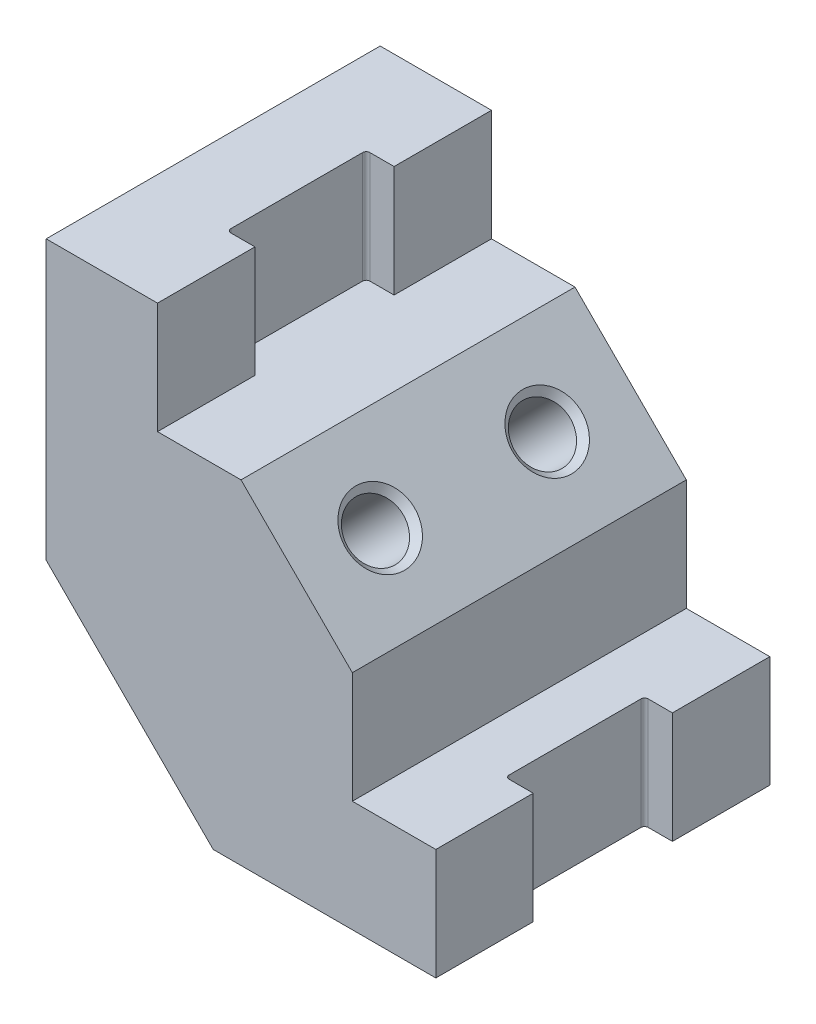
from build123d import *

# Parameters (mm, degrees)
BOSS_EXTRUDE1_DEPTH = 38.1
SKETCH2_R           = 6.35
CUT_EXTRUDE1_DEPTH  = 142.777171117
SKETCH3_W           = 6.35
SKETCH3_H           = 31.75
CUT_EXTRUDE2_DEPTH  = 25.4
SKETCH4_W           = 6.35
SKETCH4_H           = 31.75
CUT_EXTRUDE3_DEPTH  = 25.4
FILLET1_R           = 0.8382
CHAMFER1_SIZE       = 1.524


with BuildPart() as part:
    # Sketch1 → Boss-Extrude1 (new, symmetric)
    with BuildSketch(Plane.XY):
        Polygon((0, 0), (25.4, 0), (25.4, -25.4), (44.45, -25.4), (69.85, -50.8), (69.85, -76.2), (88.9, -76.2), (88.9, -101.6), (38.1, -101.6), (0, -63.5), align=None)
    extrude(amount=BOSS_EXTRUDE1_DEPTH, both=True)

    # Sketch2 → Cut-Extrude1 (cut, through all)
    with BuildSketch(Plane(origin=(9.525, 9.525, 0), x_dir=(0, 0, -1), z_dir=(0.7071067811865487, 0.7071067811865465, 0))):
        with Locations(Location((-19.05, -67.35463315, 0), (0, 0, 90))):
            Circle(SKETCH2_R)
        with Locations(Location((19.05, -67.35463315, 0), (0, 0, 90))):
            Circle(SKETCH2_R)
    extrude(amount=-CUT_EXTRUDE1_DEPTH, mode=Mode.SUBTRACT)

    # Sketch3 → Cut-Extrude2 (cut)
    with BuildSketch(Plane(origin=(0, 0, 0), x_dir=(1, 0, 0), z_dir=(0, 1, 0))):
        with Locations((22.225, 0)):
            Rectangle(SKETCH3_W, SKETCH3_H)
    extrude(amount=-CUT_EXTRUDE2_DEPTH, mode=Mode.SUBTRACT)

    # Sketch4 → Cut-Extrude3 (cut)
    with BuildSketch(Plane(origin=(0, -76.2, 0), x_dir=(1, 0, 0), z_dir=(0, 1, 0))):
        with Locations((85.725, 0)):
            Rectangle(SKETCH4_W, SKETCH4_H)
    extrude(amount=-CUT_EXTRUDE3_DEPTH, mode=Mode.SUBTRACT)

    # Fillet1
    fillet1_edges = [part.edges().sort_by_distance(p)[0] for p in [
        (19.05, -12.7, 15.875),
        (19.05, -12.7, -15.875),
        (82.55, -88.9, 15.875),
        (82.55, -88.9, -15.875),
    ]]
    fillet(fillet1_edges, radius=FILLET1_R)

    # Chamfer1
    chamfer1_edges = [part.edges().sort_by_distance(p)[0] for p in [
        (20.367045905, -83.867045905, 19.05),
        (61.642045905, -42.592045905, 19.05),
        (20.367045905, -83.867045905, -19.05),
        (61.642045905, -42.592045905, -19.05),
    ]]
    chamfer(chamfer1_edges, length=CHAMFER1_SIZE)


solid = part.part
